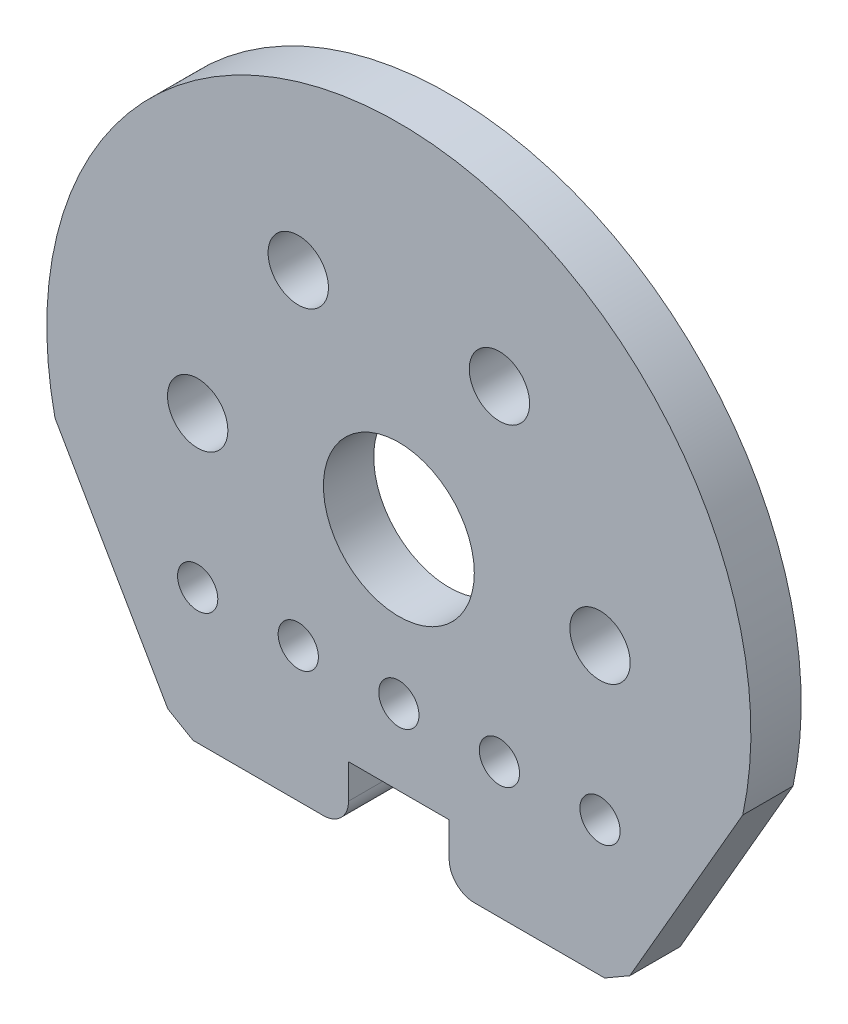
from build123d import *

# Parameters (mm, degrees)
ESQUISSE1_R        = 15
ESQUISSE1_R_2      = 6
ESQUISSE1_R_3      = 4
BOSS_EXTRU_1_DEPTH = 10


with BuildPart() as part:
    # Esquisse1 → Boss.-Extru.1 (new body)
    with BuildSketch(Plane.XY):
        with BuildLine():
            Line((-68.373971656, -15), (-45.915673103, -53.898914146))
            Line((-45.915673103, -53.898914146), (-40.915673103, -56.785665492))
            Line((-40.915673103, -56.785665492), (-15, -56.785665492))
            ThreePointArc((-15, -56.785665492), (-11.464466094, -55.321199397), (-10, -51.785665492))
            Line((-10, -51.785665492), (-10, -45))
            Line((-10, -45), (10, -45))
            Line((10, -45), (10, -51.785665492))
            ThreePointArc((10, -51.785665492), (11.464466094, -55.321199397), (15, -56.785665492))
            Line((15, -56.785665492), (40.915673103, -56.785665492))
            Line((40.915673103, -56.785665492), (45.915673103, -53.898914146))
            Line((45.915673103, -53.898914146), (68.373971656, -15))
            ThreePointArc((68.373971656, -15), (0, 70), (-68.373971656, -15))
        make_face()
        Circle(ESQUISSE1_R, mode=Mode.SUBTRACT)
        with Locations((-40, 0)):
            Circle(ESQUISSE1_R_2, mode=Mode.SUBTRACT)
        with Locations((-20, 34.641016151)):
            Circle(ESQUISSE1_R_2, mode=Mode.SUBTRACT)
        with Locations((20, 34.641016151)):
            Circle(ESQUISSE1_R_2, mode=Mode.SUBTRACT)
        with Locations((40, 0)):
            Circle(ESQUISSE1_R_2, mode=Mode.SUBTRACT)
        with Locations((-40, -30)):
            Circle(ESQUISSE1_R_3, mode=Mode.SUBTRACT)
        with Locations((-20, -30)):
            Circle(ESQUISSE1_R_3, mode=Mode.SUBTRACT)
        with Locations((0, -30)):
            Circle(ESQUISSE1_R_3, mode=Mode.SUBTRACT)
        with Locations((20, -30)):
            Circle(ESQUISSE1_R_3, mode=Mode.SUBTRACT)
        with Locations((40, -30)):
            Circle(ESQUISSE1_R_3, mode=Mode.SUBTRACT)
    extrude(amount=BOSS_EXTRU_1_DEPTH)


solid = part.part
